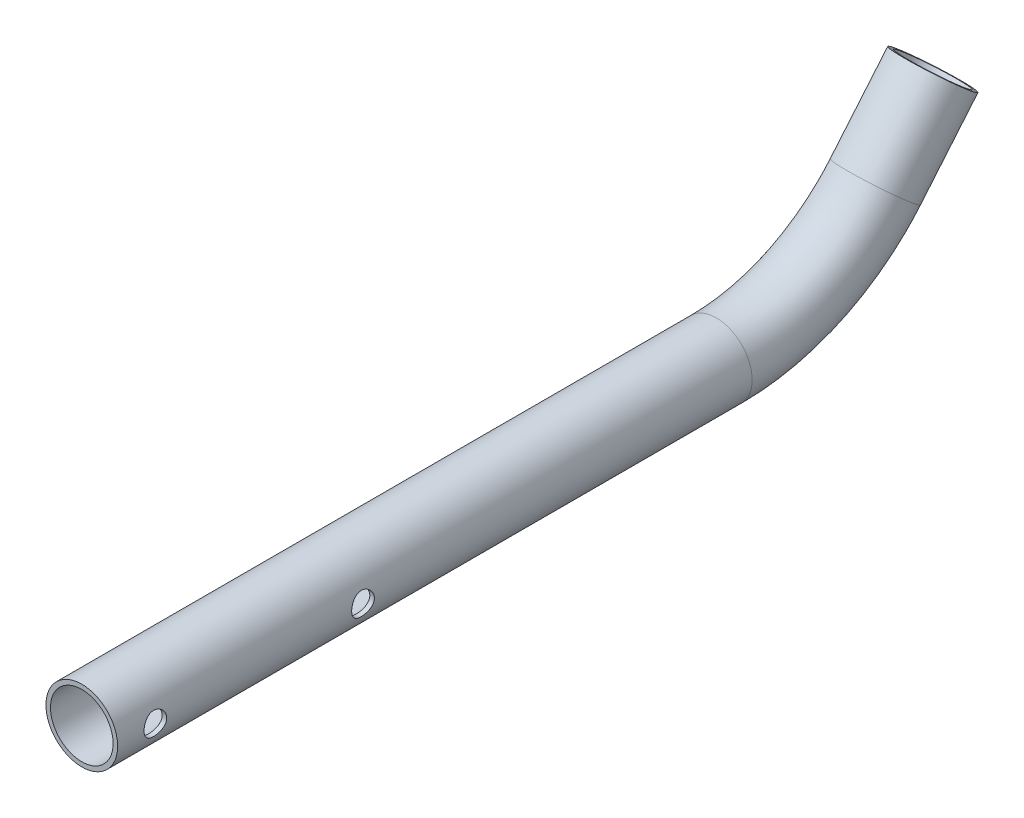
ISO-10303-21;
HEADER;
FILE_DESCRIPTION(('STEP AP214'),'2;1');
FILE_NAME('part.step','',(''),(''),'','','');
FILE_SCHEMA(('AUTOMOTIVE_DESIGN { 1 0 10303 214 1 1 1 1 }'));
ENDSEC;
DATA;
#1=APPLICATION_CONTEXT('core data for automotive mechanical design processes');
#2=APPLICATION_PROTOCOL_DEFINITION('international standard','automotive_design',2000,#1);
#3=PRODUCT_CONTEXT('',#1,'mechanical');
#4=PRODUCT('Part','Part','',(#3));
#5=PRODUCT_RELATED_PRODUCT_CATEGORY('part','',(#4));
#6=PRODUCT_DEFINITION_FORMATION('','',#4);
#7=PRODUCT_DEFINITION_CONTEXT('part definition',#1,'design');
#8=PRODUCT_DEFINITION('design','',#6,#7);
#9=PRODUCT_DEFINITION_SHAPE('','',#8);
#10=(LENGTH_UNIT() NAMED_UNIT(*) SI_UNIT(.MILLI.,.METRE.));
#11=(NAMED_UNIT(*) PLANE_ANGLE_UNIT() SI_UNIT($,.RADIAN.));
#12=(NAMED_UNIT(*) SI_UNIT($,.STERADIAN.) SOLID_ANGLE_UNIT());
#13=UNCERTAINTY_MEASURE_WITH_UNIT(LENGTH_MEASURE(1.E-05),#10,'distance_accuracy_value','');
#14=(GEOMETRIC_REPRESENTATION_CONTEXT(3) GLOBAL_UNCERTAINTY_ASSIGNED_CONTEXT((#13)) GLOBAL_UNIT_ASSIGNED_CONTEXT((#10,
#11,#12)) REPRESENTATION_CONTEXT('',''));
#15=CARTESIAN_POINT('',(0.,0.,0.));
#16=DIRECTION('',(0.,0.,1.));
#17=DIRECTION('',(1.,0.,0.));
#18=AXIS2_PLACEMENT_3D('',#15,#16,#17);
#19=CARTESIAN_POINT('',(0.,19.6466814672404,-210.217557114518));
#20=DIRECTION('',(0.,0.76604444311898,-0.642787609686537));
#21=DIRECTION('',(0.,0.642787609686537,0.76604444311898));
#22=AXIS2_PLACEMENT_3D('',#19,#20,#21);
#23=CYLINDRICAL_SURFACE('',#22,8.30000000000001);
#24=CARTESIAN_POINT('',(0.,37.8,-225.45));
#25=DIRECTION('',(0.,0.76604444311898,-0.642787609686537));
#26=DIRECTION('',(0.,0.642787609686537,0.76604444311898));
#27=AXIS2_PLACEMENT_3D('',#24,#25,#26);
#28=CIRCLE('',#27,8.30000000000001);
#29=CARTESIAN_POINT('',(0.,43.1351371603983,-219.091831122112));
#30=VERTEX_POINT('',#29);
#31=EDGE_CURVE('E17',#30,#30,#28,.T.);
#32=ORIENTED_EDGE('',*,*,#31,.T.);
#33=EDGE_LOOP('',(#32));
#34=FACE_BOUND('',#33,.T.);
#35=CARTESIAN_POINT('',(0.,19.6466814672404,-210.217557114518));
#36=DIRECTION('',(0.,0.76604444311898,-0.642787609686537));
#37=DIRECTION('',(0.,-0.642787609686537,-0.76604444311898));
#38=AXIS2_PLACEMENT_3D('',#35,#36,#37);
#39=CIRCLE('',#38,8.3);
#40=CARTESIAN_POINT('',(0.,14.3115443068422,-216.575725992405));
#41=VERTEX_POINT('',#40);
#42=EDGE_CURVE('E29',#41,#41,#39,.F.);
#43=ORIENTED_EDGE('',*,*,#42,.T.);
#44=EDGE_LOOP('',(#43));
#45=FACE_BOUND('',#44,.T.);
#46=ADVANCED_FACE('F14',(#34,#45),#23,.F.);
#47=CARTESIAN_POINT('',(0.,37.8,-225.45));
#48=DIRECTION('',(0.,-0.766044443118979,0.642787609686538));
#49=DIRECTION('',(0.,-0.642787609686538,-0.766044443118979));
#50=AXIS2_PLACEMENT_3D('',#47,#48,#49);
#51=PLANE('',#50);
#52=CARTESIAN_POINT('',(0.,37.8,-225.45));
#53=DIRECTION('',(0.,0.76604444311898,-0.642787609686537));
#54=DIRECTION('',(0.,0.642787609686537,0.76604444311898));
#55=AXIS2_PLACEMENT_3D('',#52,#53,#54);
#56=CIRCLE('',#55,9.50000000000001);
#57=CARTESIAN_POINT('',(0.,43.9064822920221,-218.17257779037));
#58=VERTEX_POINT('',#57);
#59=EDGE_CURVE('E102',#58,#58,#56,.F.);
#60=ORIENTED_EDGE('',*,*,#59,.F.);
#61=EDGE_LOOP('',(#60));
#62=FACE_BOUND('',#61,.T.);
#63=ORIENTED_EDGE('',*,*,#31,.F.);
#64=EDGE_LOOP('',(#63));
#65=FACE_BOUND('',#64,.T.);
#66=ADVANCED_FACE('F95',(#62,#65),#51,.F.);
#67=CARTESIAN_POINT('',(0.,55.,-168.085112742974));
#68=DIRECTION('',(1.,0.,0.));
#69=DIRECTION('',(0.,0.,-1.));
#70=AXIS2_PLACEMENT_3D('',#67,#68,#69);
#71=TOROIDAL_SURFACE('',#70,55.,8.3);
#72=ORIENTED_EDGE('',*,*,#42,.F.);
#73=EDGE_LOOP('',(#72));
#74=FACE_BOUND('',#73,.T.);
#75=CARTESIAN_POINT('',(0.,0.,-168.085112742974));
#76=DIRECTION('',(0.,0.,1.));
#77=DIRECTION('',(1.,0.,0.));
#78=AXIS2_PLACEMENT_3D('',#75,#76,#77);
#79=CIRCLE('',#78,8.3);
#80=CARTESIAN_POINT('',(8.3,0.,-168.085112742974));
#81=VERTEX_POINT('',#80);
#82=EDGE_CURVE('E100',#81,#81,#79,.T.);
#83=ORIENTED_EDGE('',*,*,#82,.T.);
#84=EDGE_LOOP('',(#83));
#85=FACE_BOUND('',#84,.T.);
#86=ADVANCED_FACE('F91',(#74,#85),#71,.F.);
#87=CARTESIAN_POINT('',(0.,19.6466814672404,-210.217557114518));
#88=DIRECTION('',(0.,0.76604444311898,-0.642787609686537));
#89=DIRECTION('',(0.,0.642787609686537,0.76604444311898));
#90=AXIS2_PLACEMENT_3D('',#87,#88,#89);
#91=CYLINDRICAL_SURFACE('',#90,9.50000000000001);
#92=ORIENTED_EDGE('',*,*,#59,.T.);
#93=EDGE_LOOP('',(#92));
#94=FACE_BOUND('',#93,.T.);
#95=CARTESIAN_POINT('',(0.,19.6466814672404,-210.217557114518));
#96=DIRECTION('',(0.,0.76604444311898,-0.642787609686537));
#97=DIRECTION('',(0.,-0.642787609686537,-0.76604444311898));
#98=AXIS2_PLACEMENT_3D('',#95,#96,#97);
#99=CIRCLE('',#98,9.5);
#100=CARTESIAN_POINT('',(0.,13.5401991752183,-217.494979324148));
#101=VERTEX_POINT('',#100);
#102=EDGE_CURVE('E99',#101,#101,#99,.F.);
#103=ORIENTED_EDGE('',*,*,#102,.F.);
#104=EDGE_LOOP('',(#103));
#105=FACE_BOUND('',#104,.T.);
#106=ADVANCED_FACE('F85',(#94,#105),#91,.T.);
#107=CARTESIAN_POINT('',(0.,0.,-168.085112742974));
#108=DIRECTION('',(0.,0.,1.));
#109=DIRECTION('',(1.,0.,0.));
#110=AXIS2_PLACEMENT_3D('',#107,#108,#109);
#111=CYLINDRICAL_SURFACE('',#110,8.3);
#112=CARTESIAN_POINT('',(8.3,0.,-62.));
#113=CARTESIAN_POINT('',(8.29999202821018,-0.162635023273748,-62.0000110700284));
#114=CARTESIAN_POINT('',(8.29516801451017,-0.325435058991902,-62.0132890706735));
#115=CARTESIAN_POINT('',(8.27636202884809,-0.646363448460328,-62.065933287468));
#116=CARTESIAN_POINT('',(8.26236564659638,-0.804484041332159,-62.1053405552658));
#117=CARTESIAN_POINT('',(8.2267356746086,-1.11111971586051,-62.2086711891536));
#118=CARTESIAN_POINT('',(8.20512122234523,-1.25965777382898,-62.2725331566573));
#119=CARTESIAN_POINT('',(8.15642927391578,-1.54385169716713,-62.4227204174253));
#120=CARTESIAN_POINT('',(8.12935218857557,-1.67950853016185,-62.5090440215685));
#121=CARTESIAN_POINT('',(8.07133328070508,-1.93958161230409,-62.7053296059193));
#122=CARTESIAN_POINT('',(8.0402872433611,-2.0634154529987,-62.8160322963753));
#123=CARTESIAN_POINT('',(7.97836136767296,-2.29122536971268,-63.0563650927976));
#124=CARTESIAN_POINT('',(7.94748158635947,-2.39519500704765,-63.1860013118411));
#125=CARTESIAN_POINT('',(7.88820139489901,-2.58387696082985,-63.4660329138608));
#126=CARTESIAN_POINT('',(7.8599248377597,-2.6677922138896,-63.6169941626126));
#127=CARTESIAN_POINT('',(7.81065520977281,-2.80878709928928,-63.9320715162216));
#128=CARTESIAN_POINT('',(7.78965944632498,-2.86587665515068,-64.0961827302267));
#129=CARTESIAN_POINT('',(7.75843293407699,-2.94934688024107,-64.4262447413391));
#130=CARTESIAN_POINT('',(7.74781759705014,-2.97682883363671,-64.591879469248));
#131=CARTESIAN_POINT('',(7.73742399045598,-3.00374747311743,-64.9257233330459));
#132=CARTESIAN_POINT('',(7.73764163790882,-3.00319472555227,-65.0939314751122));
#133=CARTESIAN_POINT('',(7.74855592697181,-2.97490609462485,-65.4183113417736));
#134=CARTESIAN_POINT('',(7.75867589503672,-2.948666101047,-65.5746364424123));
#135=CARTESIAN_POINT('',(7.78730121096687,-2.87220976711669,-65.8804938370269));
#136=CARTESIAN_POINT('',(7.80580776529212,-2.82198997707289,-66.0300251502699));
#137=CARTESIAN_POINT('',(7.84948967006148,-2.6981243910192,-66.3212182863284));
#138=CARTESIAN_POINT('',(7.87477943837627,-2.62407184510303,-66.462689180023));
#139=CARTESIAN_POINT('',(7.92913514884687,-2.45493236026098,-66.7316364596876));
#140=CARTESIAN_POINT('',(7.95820214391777,-2.3598395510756,-66.859108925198));
#141=CARTESIAN_POINT('',(8.0190374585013,-2.14436468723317,-67.1047577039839));
#142=CARTESIAN_POINT('',(8.05086158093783,-2.02278105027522,-67.2218691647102));
#143=CARTESIAN_POINT('',(8.11207834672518,-1.76131367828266,-67.4343768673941));
#144=CARTESIAN_POINT('',(8.1414698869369,-1.62142171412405,-67.5297632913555));
#145=CARTESIAN_POINT('',(8.1950332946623,-1.32453573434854,-67.6972184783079));
#146=CARTESIAN_POINT('',(8.2191256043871,-1.16732813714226,-67.7689389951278));
#147=CARTESIAN_POINT('',(8.248855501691,-0.923650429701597,-67.855578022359));
#148=CARTESIAN_POINT('',(8.2576950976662,-0.841148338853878,-67.8809613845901));
#149=CARTESIAN_POINT('',(8.27300710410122,-0.674069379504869,-67.9245631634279));
#150=CARTESIAN_POINT('',(8.27948055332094,-0.589493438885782,-67.9427847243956));
#151=CARTESIAN_POINT('',(8.2897307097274,-0.421072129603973,-67.9714998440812));
#152=CARTESIAN_POINT('',(8.29357105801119,-0.337261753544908,-67.9821759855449));
#153=CARTESIAN_POINT('',(8.29870777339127,-0.168982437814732,-67.9964289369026));
#154=CARTESIAN_POINT('',(8.30000414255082,-0.0845134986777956,-68.0000057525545));
#155=CARTESIAN_POINT('',(8.29999202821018,0.162635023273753,-67.9999889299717));
#156=CARTESIAN_POINT('',(8.29516801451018,0.325435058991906,-67.9867109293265));
#157=CARTESIAN_POINT('',(8.27636202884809,0.646363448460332,-67.934066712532));
#158=CARTESIAN_POINT('',(8.26236564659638,0.804484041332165,-67.8946594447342));
#159=CARTESIAN_POINT('',(8.2267356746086,1.11111971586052,-67.7913288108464));
#160=CARTESIAN_POINT('',(8.20512122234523,1.25965777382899,-67.7274668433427));
#161=CARTESIAN_POINT('',(8.15642927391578,1.54385169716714,-67.5772795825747));
#162=CARTESIAN_POINT('',(8.12935218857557,1.67950853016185,-67.4909559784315));
#163=CARTESIAN_POINT('',(8.07133328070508,1.93958161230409,-67.2946703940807));
#164=CARTESIAN_POINT('',(8.04028724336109,2.06341545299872,-67.1839677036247));
#165=CARTESIAN_POINT('',(7.97836136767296,2.29122536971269,-66.9436349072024));
#166=CARTESIAN_POINT('',(7.94748158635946,2.39519500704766,-66.8139986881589));
#167=CARTESIAN_POINT('',(7.88820139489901,2.58387696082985,-66.5339670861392));
#168=CARTESIAN_POINT('',(7.8599248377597,2.6677922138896,-66.3830058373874));
#169=CARTESIAN_POINT('',(7.81065520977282,2.80878709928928,-66.0679284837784));
#170=CARTESIAN_POINT('',(7.78965944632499,2.86587665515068,-65.9038172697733));
#171=CARTESIAN_POINT('',(7.75843293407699,2.94934688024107,-65.5737552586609));
#172=CARTESIAN_POINT('',(7.74781759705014,2.97682883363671,-65.408120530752));
#173=CARTESIAN_POINT('',(7.73742399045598,3.00374747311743,-65.0742766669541));
#174=CARTESIAN_POINT('',(7.73764163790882,3.00319472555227,-64.9060685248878));
#175=CARTESIAN_POINT('',(7.74855592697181,2.97490609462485,-64.5816886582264));
#176=CARTESIAN_POINT('',(7.75867589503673,2.94866610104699,-64.4253635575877));
#177=CARTESIAN_POINT('',(7.78730121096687,2.87220976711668,-64.119506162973));
#178=CARTESIAN_POINT('',(7.80580776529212,2.82198997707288,-63.9699748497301));
#179=CARTESIAN_POINT('',(7.84948967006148,2.69812439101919,-63.6787817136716));
#180=CARTESIAN_POINT('',(7.87477943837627,2.62407184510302,-63.537310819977));
#181=CARTESIAN_POINT('',(7.92913514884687,2.45493236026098,-63.2683635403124));
#182=CARTESIAN_POINT('',(7.95820214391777,2.35983955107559,-63.140891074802));
#183=CARTESIAN_POINT('',(8.0190374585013,2.14436468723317,-62.8952422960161));
#184=CARTESIAN_POINT('',(8.05086158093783,2.02278105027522,-62.7781308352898));
#185=CARTESIAN_POINT('',(8.11207834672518,1.76131367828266,-62.5656231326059));
#186=CARTESIAN_POINT('',(8.1414698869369,1.62142171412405,-62.4702367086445));
#187=CARTESIAN_POINT('',(8.1950332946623,1.32453573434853,-62.3027815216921));
#188=CARTESIAN_POINT('',(8.21912560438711,1.16732813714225,-62.2310610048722));
#189=CARTESIAN_POINT('',(8.248855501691,0.923650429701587,-62.144421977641));
#190=CARTESIAN_POINT('',(8.2576950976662,0.841148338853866,-62.1190386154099));
#191=CARTESIAN_POINT('',(8.27300710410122,0.674069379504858,-62.0754368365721));
#192=CARTESIAN_POINT('',(8.27948055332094,0.589493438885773,-62.0572152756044));
#193=CARTESIAN_POINT('',(8.2897307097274,0.421072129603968,-62.0285001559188));
#194=CARTESIAN_POINT('',(8.29357105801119,0.337261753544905,-62.0178240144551));
#195=CARTESIAN_POINT('',(8.29870777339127,0.168982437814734,-62.0035710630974));
#196=CARTESIAN_POINT('',(8.30000414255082,0.0845134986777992,-61.9999942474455));
#197=CARTESIAN_POINT('',(8.3,0.,-62.));
#198=B_SPLINE_CURVE_WITH_KNOTS('',3,(#112,#113,#114,#115,#116,#117,#118,#119,#120,#121,#122,
#123,#124,#125,#126,#127,#128,#129,#130,#131,#132,#133,#134,#135,#136,#137,#138,#139,#140,#141,
#142,#143,#144,#145,#146,#147,#148,#149,#150,#151,#152,#153,#154,#155,#156,#157,#158,#159,#160,
#161,#162,#163,#164,#165,#166,#167,#168,#169,#170,#171,#172,#173,#174,#175,#176,#177,#178,#179,
#180,#181,#182,#183,#184,#185,#186,#187,#188,#189,#190,#191,#192,#193,#194,#195,#196,#197),
.UNSPECIFIED.,.T.,.F.,(4,2,2,2,2,2,2,2,2,2,2,2,2,2,2,2,2,2,2,2,2,2,2,2,2,2,2,2,2,2,2,2,2,2,2,2,
2,2,2,2,2,2,4),(0.,0.487591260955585,0.975950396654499,1.4630913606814,1.95019570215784,
2.45488066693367,2.95972894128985,3.48216493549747,4.00440751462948,4.506472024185,
5.0083473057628,5.48263519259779,5.95699133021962,6.43991557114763,6.92297471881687,
7.43595440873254,7.94916546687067,8.46962273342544,8.72964167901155,8.98954633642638,
9.24292396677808,9.4963013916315,9.98389265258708,10.472251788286,10.9593927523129,
11.4464970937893,11.9511820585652,12.4560303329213,12.978466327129,13.500708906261,
14.0027734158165,14.5046486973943,14.9789365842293,15.4532927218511,15.9362169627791,
16.4192761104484,16.9322558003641,17.4454668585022,17.965924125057,18.2259430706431,
18.4858477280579,18.7392253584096,18.992602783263),.UNSPECIFIED.);
#199=CARTESIAN_POINT('',(8.3,0.,-62.));
#200=VERTEX_POINT('',#199);
#201=EDGE_CURVE('E69',#200,#200,#198,.T.);
#202=ORIENTED_EDGE('',*,*,#201,.T.);
#203=EDGE_LOOP('',(#202));
#204=FACE_BOUND('',#203,.T.);
#205=CARTESIAN_POINT('',(8.3,0.,-7.));
#206=CARTESIAN_POINT('',(8.29999202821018,-0.162635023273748,-7.00001107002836));
#207=CARTESIAN_POINT('',(8.29516801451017,-0.325435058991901,-7.01328907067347));
#208=CARTESIAN_POINT('',(8.27636202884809,-0.646363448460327,-7.06593328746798));
#209=CARTESIAN_POINT('',(8.26236564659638,-0.804484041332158,-7.10534055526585));
#210=CARTESIAN_POINT('',(8.2267356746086,-1.11111971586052,-7.20867118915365));
#211=CARTESIAN_POINT('',(8.20512122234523,-1.25965777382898,-7.27253315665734));
#212=CARTESIAN_POINT('',(8.15642927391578,-1.54385169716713,-7.42272041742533));
#213=CARTESIAN_POINT('',(8.12935218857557,-1.67950853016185,-7.50904402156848));
#214=CARTESIAN_POINT('',(8.07133328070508,-1.93958161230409,-7.70532960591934));
#215=CARTESIAN_POINT('',(8.0402872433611,-2.0634154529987,-7.81603229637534));
#216=CARTESIAN_POINT('',(7.97836136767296,-2.29122536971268,-8.05636509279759));
#217=CARTESIAN_POINT('',(7.94748158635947,-2.39519500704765,-8.18600131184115));
#218=CARTESIAN_POINT('',(7.88820139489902,-2.58387696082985,-8.46603291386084));
#219=CARTESIAN_POINT('',(7.85992483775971,-2.66779221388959,-8.61699416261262));
#220=CARTESIAN_POINT('',(7.81065520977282,-2.80878709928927,-8.93207151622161));
#221=CARTESIAN_POINT('',(7.78965944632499,-2.86587665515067,-9.09618273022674));
#222=CARTESIAN_POINT('',(7.75843293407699,-2.94934688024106,-9.42624474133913));
#223=CARTESIAN_POINT('',(7.74781759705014,-2.9768288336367,-9.59187946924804));
#224=CARTESIAN_POINT('',(7.73742399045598,-3.00374747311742,-9.92572333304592));
#225=CARTESIAN_POINT('',(7.73764163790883,-3.00319472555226,-10.0939314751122));
#226=CARTESIAN_POINT('',(7.74855592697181,-2.97490609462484,-10.4183113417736));
#227=CARTESIAN_POINT('',(7.75867589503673,-2.94866610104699,-10.5746364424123));
#228=CARTESIAN_POINT('',(7.78730121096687,-2.87220976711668,-10.8804938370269));
#229=CARTESIAN_POINT('',(7.80580776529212,-2.82198997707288,-11.0300251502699));
#230=CARTESIAN_POINT('',(7.84948967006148,-2.69812439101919,-11.3212182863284));
#231=CARTESIAN_POINT('',(7.87477943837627,-2.62407184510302,-11.462689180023));
#232=CARTESIAN_POINT('',(7.92913514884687,-2.45493236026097,-11.7316364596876));
#233=CARTESIAN_POINT('',(7.95820214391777,-2.35983955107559,-11.859108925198));
#234=CARTESIAN_POINT('',(8.0190374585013,-2.14436468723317,-12.1047577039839));
#235=CARTESIAN_POINT('',(8.05086158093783,-2.02278105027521,-12.2218691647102));
#236=CARTESIAN_POINT('',(8.11207834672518,-1.76131367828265,-12.4343768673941));
#237=CARTESIAN_POINT('',(8.1414698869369,-1.62142171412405,-12.5297632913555));
#238=CARTESIAN_POINT('',(8.1950332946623,-1.32453573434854,-12.6972184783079));
#239=CARTESIAN_POINT('',(8.2191256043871,-1.16732813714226,-12.7689389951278));
#240=CARTESIAN_POINT('',(8.248855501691,-0.92365042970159,-12.855578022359));
#241=CARTESIAN_POINT('',(8.2576950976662,-0.84114833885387,-12.8809613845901));
#242=CARTESIAN_POINT('',(8.27300710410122,-0.674069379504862,-12.9245631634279));
#243=CARTESIAN_POINT('',(8.27948055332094,-0.589493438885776,-12.9427847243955));
#244=CARTESIAN_POINT('',(8.2897307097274,-0.42107212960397,-12.9714998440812));
#245=CARTESIAN_POINT('',(8.29357105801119,-0.337261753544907,-12.9821759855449));
#246=CARTESIAN_POINT('',(8.29870777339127,-0.168982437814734,-12.9964289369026));
#247=CARTESIAN_POINT('',(8.30000414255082,-0.0845134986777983,-13.0000057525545));
#248=CARTESIAN_POINT('',(8.29999202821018,0.16263502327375,-12.9999889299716));
#249=CARTESIAN_POINT('',(8.29516801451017,0.325435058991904,-12.9867109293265));
#250=CARTESIAN_POINT('',(8.27636202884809,0.646363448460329,-12.934066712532));
#251=CARTESIAN_POINT('',(8.26236564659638,0.80448404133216,-12.8946594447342));
#252=CARTESIAN_POINT('',(8.2267356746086,1.11111971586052,-12.7913288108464));
#253=CARTESIAN_POINT('',(8.20512122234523,1.25965777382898,-12.7274668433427));
#254=CARTESIAN_POINT('',(8.15642927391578,1.54385169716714,-12.5772795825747));
#255=CARTESIAN_POINT('',(8.12935218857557,1.67950853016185,-12.4909559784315));
#256=CARTESIAN_POINT('',(8.07133328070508,1.93958161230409,-12.2946703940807));
#257=CARTESIAN_POINT('',(8.0402872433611,2.06341545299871,-12.1839677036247));
#258=CARTESIAN_POINT('',(7.97836136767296,2.29122536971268,-11.9436349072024));
#259=CARTESIAN_POINT('',(7.94748158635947,2.39519500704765,-11.8139986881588));
#260=CARTESIAN_POINT('',(7.88820139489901,2.58387696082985,-11.5339670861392));
#261=CARTESIAN_POINT('',(7.85992483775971,2.66779221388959,-11.3830058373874));
#262=CARTESIAN_POINT('',(7.81065520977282,2.80878709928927,-11.0679284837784));
#263=CARTESIAN_POINT('',(7.78965944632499,2.86587665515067,-10.9038172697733));
#264=CARTESIAN_POINT('',(7.75843293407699,2.94934688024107,-10.5737552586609));
#265=CARTESIAN_POINT('',(7.74781759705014,2.9768288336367,-10.408120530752));
#266=CARTESIAN_POINT('',(7.73742399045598,3.00374747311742,-10.0742766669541));
#267=CARTESIAN_POINT('',(7.73764163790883,3.00319472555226,-9.90606852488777));
#268=CARTESIAN_POINT('',(7.74855592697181,2.97490609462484,-9.58168865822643));
#269=CARTESIAN_POINT('',(7.75867589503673,2.94866610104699,-9.4253635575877));
#270=CARTESIAN_POINT('',(7.78730121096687,2.87220976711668,-9.11950616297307));
#271=CARTESIAN_POINT('',(7.80580776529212,2.82198997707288,-8.96997484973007));
#272=CARTESIAN_POINT('',(7.84948967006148,2.69812439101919,-8.67878171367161));
#273=CARTESIAN_POINT('',(7.87477943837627,2.62407184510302,-8.53731081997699));
#274=CARTESIAN_POINT('',(7.92913514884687,2.45493236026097,-8.26836354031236));
#275=CARTESIAN_POINT('',(7.95820214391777,2.35983955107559,-8.14089107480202));
#276=CARTESIAN_POINT('',(8.0190374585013,2.14436468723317,-7.89524229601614));
#277=CARTESIAN_POINT('',(8.05086158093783,2.02278105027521,-7.77813083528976));
#278=CARTESIAN_POINT('',(8.11207834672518,1.76131367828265,-7.56562313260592));
#279=CARTESIAN_POINT('',(8.1414698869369,1.62142171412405,-7.4702367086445));
#280=CARTESIAN_POINT('',(8.1950332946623,1.32453573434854,-7.30278152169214));
#281=CARTESIAN_POINT('',(8.21912560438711,1.16732813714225,-7.23106100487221));
#282=CARTESIAN_POINT('',(8.248855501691,0.923650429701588,-7.14442197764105));
#283=CARTESIAN_POINT('',(8.2576950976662,0.841148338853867,-7.11903861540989));
#284=CARTESIAN_POINT('',(8.27300710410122,0.674069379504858,-7.07543683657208));
#285=CARTESIAN_POINT('',(8.27948055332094,0.589493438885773,-7.05721527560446));
#286=CARTESIAN_POINT('',(8.2897307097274,0.421072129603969,-7.0285001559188));
#287=CARTESIAN_POINT('',(8.29357105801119,0.337261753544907,-7.01782401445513));
#288=CARTESIAN_POINT('',(8.29870777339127,0.168982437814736,-7.0035710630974));
#289=CARTESIAN_POINT('',(8.30000414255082,0.0845134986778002,-6.99999424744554));
#290=CARTESIAN_POINT('',(8.3,0.,-7.));
#291=B_SPLINE_CURVE_WITH_KNOTS('',3,(#205,#206,#207,#208,#209,#210,#211,#212,#213,#214,#215,
#216,#217,#218,#219,#220,#221,#222,#223,#224,#225,#226,#227,#228,#229,#230,#231,#232,#233,#234,
#235,#236,#237,#238,#239,#240,#241,#242,#243,#244,#245,#246,#247,#248,#249,#250,#251,#252,#253,
#254,#255,#256,#257,#258,#259,#260,#261,#262,#263,#264,#265,#266,#267,#268,#269,#270,#271,#272,
#273,#274,#275,#276,#277,#278,#279,#280,#281,#282,#283,#284,#285,#286,#287,#288,#289,#290),
.UNSPECIFIED.,.T.,.F.,(4,2,2,2,2,2,2,2,2,2,2,2,2,2,2,2,2,2,2,2,2,2,2,2,2,2,2,2,2,2,2,2,2,2,2,2,
2,2,2,2,2,2,4),(0.,0.487591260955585,0.975950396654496,1.46309136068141,1.95019570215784,
2.45488066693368,2.95972894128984,3.48216493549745,4.00440751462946,4.50647202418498,
5.00834730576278,5.48263519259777,5.95699133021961,6.43991557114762,6.92297471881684,
7.43595440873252,7.94916546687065,8.46962273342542,8.72964167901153,8.98954633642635,
9.24292396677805,9.49630139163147,9.98389265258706,10.472251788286,10.9593927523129,
11.4464970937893,11.9511820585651,12.4560303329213,12.9784663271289,13.5007089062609,
14.0027734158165,14.5046486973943,14.9789365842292,15.4532927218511,15.9362169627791,
16.4192761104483,16.932255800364,17.4454668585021,17.9659241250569,18.225943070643,
18.4858477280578,18.7392253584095,18.9926027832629),.UNSPECIFIED.);
#292=CARTESIAN_POINT('',(8.3,0.,-7.));
#293=VERTEX_POINT('',#292);
#294=EDGE_CURVE('E65',#293,#293,#291,.T.);
#295=ORIENTED_EDGE('',*,*,#294,.T.);
#296=EDGE_LOOP('',(#295));
#297=FACE_BOUND('',#296,.T.);
#298=CARTESIAN_POINT('',(0.,0.,0.));
#299=DIRECTION('',(0.,0.,1.));
#300=DIRECTION('',(1.,0.,0.));
#301=AXIS2_PLACEMENT_3D('',#298,#299,#300);
#302=CIRCLE('',#301,8.3);
#303=CARTESIAN_POINT('',(8.3,0.,0.));
#304=VERTEX_POINT('',#303);
#305=EDGE_CURVE('E62',#304,#304,#302,.F.);
#306=ORIENTED_EDGE('',*,*,#305,.F.);
#307=EDGE_LOOP('',(#306));
#308=FACE_BOUND('',#307,.T.);
#309=ORIENTED_EDGE('',*,*,#82,.F.);
#310=EDGE_LOOP('',(#309));
#311=FACE_BOUND('',#310,.T.);
#312=ADVANCED_FACE('F79',(#204,#297,#308,#311),#111,.F.);
#313=CARTESIAN_POINT('',(0.,55.,-168.085112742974));
#314=DIRECTION('',(1.,0.,0.));
#315=DIRECTION('',(0.,0.,-1.));
#316=AXIS2_PLACEMENT_3D('',#313,#314,#315);
#317=TOROIDAL_SURFACE('',#316,55.,9.5);
#318=ORIENTED_EDGE('',*,*,#102,.T.);
#319=EDGE_LOOP('',(#318));
#320=FACE_BOUND('',#319,.T.);
#321=CARTESIAN_POINT('',(0.,0.,-168.085112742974));
#322=DIRECTION('',(0.,0.,1.));
#323=DIRECTION('',(1.,0.,0.));
#324=AXIS2_PLACEMENT_3D('',#321,#322,#323);
#325=CIRCLE('',#324,9.5);
#326=CARTESIAN_POINT('',(9.5,0.,-168.085112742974));
#327=VERTEX_POINT('',#326);
#328=EDGE_CURVE('E64',#327,#327,#325,.T.);
#329=ORIENTED_EDGE('',*,*,#328,.F.);
#330=EDGE_LOOP('',(#329));
#331=FACE_BOUND('',#330,.T.);
#332=ADVANCED_FACE('F84',(#320,#331),#317,.T.);
#333=CARTESIAN_POINT('',(22.5,0.,-65.));
#334=DIRECTION('',(-1.,0.,0.));
#335=DIRECTION('',(0.,0.,1.));
#336=AXIS2_PLACEMENT_3D('',#333,#334,#335);
#337=CYLINDRICAL_SURFACE('',#336,3.00000000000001);
#338=ORIENTED_EDGE('',*,*,#201,.F.);
#339=EDGE_LOOP('',(#338));
#340=FACE_BOUND('',#339,.T.);
#341=CARTESIAN_POINT('',(9.5,0.,-68.));
#342=CARTESIAN_POINT('',(9.4999937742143,-0.163947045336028,-67.9999909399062));
#343=CARTESIAN_POINT('',(9.49570969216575,-0.328068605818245,-67.9864986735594));
#344=CARTESIAN_POINT('',(9.47901316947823,-0.651672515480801,-67.9329698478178));
#345=CARTESIAN_POINT('',(9.46658677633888,-0.811146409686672,-67.8928877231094));
#346=CARTESIAN_POINT('',(9.4349679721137,-1.12049232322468,-67.7876731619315));
#347=CARTESIAN_POINT('',(9.41579022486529,-1.27038432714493,-67.7225949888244));
#348=CARTESIAN_POINT('',(9.37264977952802,-1.55707428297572,-67.569425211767));
#349=CARTESIAN_POINT('',(9.34868780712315,-1.69387421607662,-67.4813370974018));
#350=CARTESIAN_POINT('',(9.2976682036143,-1.95488205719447,-67.2817080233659));
#351=CARTESIAN_POINT('',(9.27054182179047,-2.07862012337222,-67.1695703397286));
#352=CARTESIAN_POINT('',(9.21664498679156,-2.3058894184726,-66.9262905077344));
#353=CARTESIAN_POINT('',(9.18987462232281,-2.40941569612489,-66.7951437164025));
#354=CARTESIAN_POINT('',(9.13898586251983,-2.59586956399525,-66.5135020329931));
#355=CARTESIAN_POINT('',(9.11495170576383,-2.67820968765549,-66.3626015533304));
#356=CARTESIAN_POINT('',(9.07328714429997,-2.81614810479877,-66.0482141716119));
#357=CARTESIAN_POINT('',(9.0556549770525,-2.87175375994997,-65.8847307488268));
#358=CARTESIAN_POINT('',(9.02950721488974,-2.95292727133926,-65.5551022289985));
#359=CARTESIAN_POINT('',(9.02072856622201,-2.97936419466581,-65.3891925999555));
#360=CARTESIAN_POINT('',(9.01250122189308,-3.00416514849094,-65.0550782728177));
#361=CARTESIAN_POINT('',(9.01304998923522,-3.00253681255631,-64.8868742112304));
#362=CARTESIAN_POINT('',(9.02318351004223,-2.97193251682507,-64.5601693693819));
#363=CARTESIAN_POINT('',(9.0324017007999,-2.94406591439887,-64.4015513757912));
#364=CARTESIAN_POINT('',(9.05823932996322,-2.863576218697,-64.0913677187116));
#365=CARTESIAN_POINT('',(9.0748596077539,-2.8109503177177,-63.9398028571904));
#366=CARTESIAN_POINT('',(9.1139070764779,-2.68165987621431,-63.6454012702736));
#367=CARTESIAN_POINT('',(9.13641695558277,-2.60464945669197,-63.5027278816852));
#368=CARTESIAN_POINT('',(9.1846682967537,-2.42902069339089,-63.2319750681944));
#369=CARTESIAN_POINT('',(9.21041043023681,-2.33039785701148,-63.1038986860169));
#370=CARTESIAN_POINT('',(9.26368893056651,-2.10893510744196,-62.8597194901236));
#371=CARTESIAN_POINT('',(9.29125313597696,-1.98518405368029,-62.7444476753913));
#372=CARTESIAN_POINT('',(9.34402885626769,-1.71971338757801,-62.5360465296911));
#373=CARTESIAN_POINT('',(9.3692393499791,-1.57798603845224,-62.4429267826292));
#374=CARTESIAN_POINT('',(9.41474581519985,-1.27891839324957,-62.2808909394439));
#375=CARTESIAN_POINT('',(9.43499652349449,-1.12145152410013,-62.2121953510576));
#376=CARTESIAN_POINT('',(9.4679435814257,-0.796582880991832,-62.1026358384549));
#377=CARTESIAN_POINT('',(9.48065545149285,-0.629202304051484,-62.0617147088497));
#378=CARTESIAN_POINT('',(9.49256029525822,-0.383587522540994,-62.0236270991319));
#379=CARTESIAN_POINT('',(9.49534217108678,-0.307177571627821,-62.0147773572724));
#380=CARTESIAN_POINT('',(9.49906348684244,-0.153857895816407,-62.0029616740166));
#381=CARTESIAN_POINT('',(9.50000292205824,-0.0769481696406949,-61.9999957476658));
#382=CARTESIAN_POINT('',(9.4999937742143,0.163947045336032,-62.0000090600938));
#383=CARTESIAN_POINT('',(9.49570969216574,0.32806860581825,-62.0135013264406));
#384=CARTESIAN_POINT('',(9.47901316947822,0.651672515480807,-62.0670301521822));
#385=CARTESIAN_POINT('',(9.46658677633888,0.811146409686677,-62.1071122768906));
#386=CARTESIAN_POINT('',(9.4349679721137,1.12049232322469,-62.2123268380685));
#387=CARTESIAN_POINT('',(9.41579022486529,1.27038432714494,-62.2774050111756));
#388=CARTESIAN_POINT('',(9.37264977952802,1.55707428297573,-62.430574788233));
#389=CARTESIAN_POINT('',(9.34868780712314,1.69387421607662,-62.5186629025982));
#390=CARTESIAN_POINT('',(9.2976682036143,1.95488205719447,-62.7182919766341));
#391=CARTESIAN_POINT('',(9.27054182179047,2.07862012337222,-62.8304296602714));
#392=CARTESIAN_POINT('',(9.21664498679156,2.3058894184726,-63.0737094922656));
#393=CARTESIAN_POINT('',(9.18987462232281,2.40941569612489,-63.2048562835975));
#394=CARTESIAN_POINT('',(9.13898586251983,2.59586956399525,-63.4864979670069));
#395=CARTESIAN_POINT('',(9.11495170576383,2.6782096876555,-63.6373984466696));
#396=CARTESIAN_POINT('',(9.07328714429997,2.81614810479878,-63.9517858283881));
#397=CARTESIAN_POINT('',(9.0556549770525,2.87175375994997,-64.1152692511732));
#398=CARTESIAN_POINT('',(9.02950721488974,2.95292727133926,-64.4448977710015));
#399=CARTESIAN_POINT('',(9.02072856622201,2.97936419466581,-64.6108074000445));
#400=CARTESIAN_POINT('',(9.01250122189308,3.00416514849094,-64.9449217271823));
#401=CARTESIAN_POINT('',(9.01304998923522,3.00253681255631,-65.1131257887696));
#402=CARTESIAN_POINT('',(9.02318351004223,2.97193251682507,-65.4398306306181));
#403=CARTESIAN_POINT('',(9.0324017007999,2.94406591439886,-65.5984486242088));
#404=CARTESIAN_POINT('',(9.05823932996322,2.86357621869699,-65.9086322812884));
#405=CARTESIAN_POINT('',(9.0748596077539,2.81095031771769,-66.0601971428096));
#406=CARTESIAN_POINT('',(9.11390707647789,2.68165987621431,-66.3545987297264));
#407=CARTESIAN_POINT('',(9.13641695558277,2.60464945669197,-66.4972721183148));
#408=CARTESIAN_POINT('',(9.1846682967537,2.42902069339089,-66.7680249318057));
#409=CARTESIAN_POINT('',(9.21041043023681,2.33039785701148,-66.8961013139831));
#410=CARTESIAN_POINT('',(9.26368893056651,2.10893510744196,-67.1402805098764));
#411=CARTESIAN_POINT('',(9.29125313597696,1.98518405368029,-67.2555523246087));
#412=CARTESIAN_POINT('',(9.34402885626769,1.71971338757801,-67.4639534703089));
#413=CARTESIAN_POINT('',(9.3692393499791,1.57798603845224,-67.5570732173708));
#414=CARTESIAN_POINT('',(9.41474581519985,1.27891839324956,-67.7191090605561));
#415=CARTESIAN_POINT('',(9.43499652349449,1.12145152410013,-67.7878046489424));
#416=CARTESIAN_POINT('',(9.4679435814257,0.796582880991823,-67.8973641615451));
#417=CARTESIAN_POINT('',(9.48065545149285,0.629202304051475,-67.9382852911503));
#418=CARTESIAN_POINT('',(9.49256029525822,0.383587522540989,-67.9763729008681));
#419=CARTESIAN_POINT('',(9.49534217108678,0.307177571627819,-67.9852226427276));
#420=CARTESIAN_POINT('',(9.49906348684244,0.153857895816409,-67.9970383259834));
#421=CARTESIAN_POINT('',(9.50000292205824,0.0769481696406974,-68.0000042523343));
#422=CARTESIAN_POINT('',(9.5,0.,-68.));
#423=B_SPLINE_CURVE_WITH_KNOTS('',3,(#341,#342,#343,#344,#345,#346,#347,#348,#349,#350,#351,
#352,#353,#354,#355,#356,#357,#358,#359,#360,#361,#362,#363,#364,#365,#366,#367,#368,#369,#370,
#371,#372,#373,#374,#375,#376,#377,#378,#379,#380,#381,#382,#383,#384,#385,#386,#387,#388,#389,
#390,#391,#392,#393,#394,#395,#396,#397,#398,#399,#400,#401,#402,#403,#404,#405,#406,#407,#408,
#409,#410,#411,#412,#413,#414,#415,#416,#417,#418,#419,#420,#421,#422),.UNSPECIFIED.,.T.,.F.,(4,
2,2,2,2,2,2,2,2,2,2,2,2,2,2,2,2,2,2,2,2,2,2,2,2,2,2,2,2,2,2,2,2,2,2,2,2,2,2,2,4),(0.,
0.491544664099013,0.983933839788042,1.47526008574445,1.96651186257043,2.4717607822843,
2.97713331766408,3.49529282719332,4.01330957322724,4.51543654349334,5.01742694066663,
5.49910302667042,5.98083374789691,6.46972911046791,6.95872619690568,7.47040623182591,
7.98230723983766,8.49871900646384,9.01406389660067,9.24476866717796,9.4754740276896,
9.96701869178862,10.4594078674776,10.9507341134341,11.44198589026,11.9472348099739,
12.4526073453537,12.970766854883,13.4887836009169,13.990910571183,14.4929009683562,
14.97457705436,15.4563077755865,15.9452031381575,16.4342002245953,16.9458802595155,
17.4577812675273,17.9741930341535,18.4895379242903,18.7202426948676,18.9509480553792),.UNSPECIFIED.);
#424=CARTESIAN_POINT('',(9.5,0.,-68.));
#425=VERTEX_POINT('',#424);
#426=EDGE_CURVE('E26',#425,#425,#423,.T.);
#427=ORIENTED_EDGE('',*,*,#426,.F.);
#428=EDGE_LOOP('',(#427));
#429=FACE_BOUND('',#428,.T.);
#430=ADVANCED_FACE('F57',(#340,#429),#337,.F.);
#431=CARTESIAN_POINT('',(22.5,0.,-10.));
#432=DIRECTION('',(-1.,0.,0.));
#433=DIRECTION('',(0.,0.,1.));
#434=AXIS2_PLACEMENT_3D('',#431,#432,#433);
#435=CYLINDRICAL_SURFACE('',#434,3.);
#436=ORIENTED_EDGE('',*,*,#294,.F.);
#437=EDGE_LOOP('',(#436));
#438=FACE_BOUND('',#437,.T.);
#439=CARTESIAN_POINT('',(9.5,0.,-13.));
#440=CARTESIAN_POINT('',(9.4999937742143,-0.163947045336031,-12.9999909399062));
#441=CARTESIAN_POINT('',(9.49570969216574,-0.328068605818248,-12.9864986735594));
#442=CARTESIAN_POINT('',(9.47901316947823,-0.651672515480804,-12.9329698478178));
#443=CARTESIAN_POINT('',(9.46658677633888,-0.811146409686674,-12.8928877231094));
#444=CARTESIAN_POINT('',(9.4349679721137,-1.12049232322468,-12.7876731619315));
#445=CARTESIAN_POINT('',(9.41579022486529,-1.27038432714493,-12.7225949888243));
#446=CARTESIAN_POINT('',(9.37264977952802,-1.55707428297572,-12.569425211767));
#447=CARTESIAN_POINT('',(9.34868780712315,-1.69387421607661,-12.4813370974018));
#448=CARTESIAN_POINT('',(9.2976682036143,-1.95488205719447,-12.2817080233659));
#449=CARTESIAN_POINT('',(9.27054182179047,-2.07862012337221,-12.1695703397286));
#450=CARTESIAN_POINT('',(9.21664498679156,-2.3058894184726,-11.9262905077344));
#451=CARTESIAN_POINT('',(9.18987462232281,-2.40941569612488,-11.7951437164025));
#452=CARTESIAN_POINT('',(9.13898586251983,-2.59586956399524,-11.5135020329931));
#453=CARTESIAN_POINT('',(9.11495170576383,-2.67820968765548,-11.3626015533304));
#454=CARTESIAN_POINT('',(9.07328714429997,-2.81614810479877,-11.0482141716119));
#455=CARTESIAN_POINT('',(9.0556549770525,-2.87175375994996,-10.8847307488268));
#456=CARTESIAN_POINT('',(9.02950721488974,-2.95292727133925,-10.5551022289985));
#457=CARTESIAN_POINT('',(9.02072856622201,-2.9793641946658,-10.3891925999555));
#458=CARTESIAN_POINT('',(9.01250122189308,-3.00416514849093,-10.0550782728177));
#459=CARTESIAN_POINT('',(9.01304998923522,-3.0025368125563,-9.88687421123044));
#460=CARTESIAN_POINT('',(9.02318351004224,-2.97193251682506,-9.56016936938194));
#461=CARTESIAN_POINT('',(9.0324017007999,-2.94406591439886,-9.4015513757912));
#462=CARTESIAN_POINT('',(9.05823932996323,-2.86357621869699,-9.09136771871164));
#463=CARTESIAN_POINT('',(9.0748596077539,-2.81095031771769,-8.93980285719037));
#464=CARTESIAN_POINT('',(9.1139070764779,-2.68165987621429,-8.6454012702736));
#465=CARTESIAN_POINT('',(9.13641695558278,-2.60464945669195,-8.50272788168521));
#466=CARTESIAN_POINT('',(9.18466829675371,-2.42902069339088,-8.23197506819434));
#467=CARTESIAN_POINT('',(9.21041043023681,-2.33039785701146,-8.10389868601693));
#468=CARTESIAN_POINT('',(9.26368893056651,-2.10893510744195,-7.85971949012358));
#469=CARTESIAN_POINT('',(9.29125313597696,-1.98518405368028,-7.74444767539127));
#470=CARTESIAN_POINT('',(9.34402885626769,-1.719713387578,-7.53604652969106));
#471=CARTESIAN_POINT('',(9.3692393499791,-1.57798603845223,-7.44292678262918));
#472=CARTESIAN_POINT('',(9.41474581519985,-1.27891839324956,-7.28089093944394));
#473=CARTESIAN_POINT('',(9.43499652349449,-1.12145152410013,-7.2121953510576));
#474=CARTESIAN_POINT('',(9.4679435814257,-0.796582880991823,-7.10263583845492));
#475=CARTESIAN_POINT('',(9.48065545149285,-0.629202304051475,-7.06171470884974));
#476=CARTESIAN_POINT('',(9.49256029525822,-0.383587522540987,-7.02362709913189));
#477=CARTESIAN_POINT('',(9.49534217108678,-0.307177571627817,-7.01477735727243));
#478=CARTESIAN_POINT('',(9.49906348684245,-0.153857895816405,-7.00296167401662));
#479=CARTESIAN_POINT('',(9.50000292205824,-0.0769481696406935,-6.99999574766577));
#480=CARTESIAN_POINT('',(9.4999937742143,0.163947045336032,-7.00000906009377));
#481=CARTESIAN_POINT('',(9.49570969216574,0.328068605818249,-7.01350132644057));
#482=CARTESIAN_POINT('',(9.47901316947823,0.651672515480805,-7.06703015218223));
#483=CARTESIAN_POINT('',(9.46658677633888,0.811146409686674,-7.10711227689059));
#484=CARTESIAN_POINT('',(9.4349679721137,1.12049232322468,-7.21232683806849));
#485=CARTESIAN_POINT('',(9.41579022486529,1.27038432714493,-7.27740501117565));
#486=CARTESIAN_POINT('',(9.37264977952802,1.55707428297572,-7.43057478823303));
#487=CARTESIAN_POINT('',(9.34868780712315,1.69387421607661,-7.5186629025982));
#488=CARTESIAN_POINT('',(9.2976682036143,1.95488205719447,-7.71829197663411));
#489=CARTESIAN_POINT('',(9.27054182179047,2.07862012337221,-7.83042966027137));
#490=CARTESIAN_POINT('',(9.21664498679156,2.3058894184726,-8.07370949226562));
#491=CARTESIAN_POINT('',(9.18987462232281,2.40941569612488,-8.2048562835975));
#492=CARTESIAN_POINT('',(9.13898586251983,2.59586956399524,-8.48649796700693));
#493=CARTESIAN_POINT('',(9.11495170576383,2.67820968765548,-8.63739844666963));
#494=CARTESIAN_POINT('',(9.07328714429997,2.81614810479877,-8.95178582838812));
#495=CARTESIAN_POINT('',(9.0556549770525,2.87175375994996,-9.11526925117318));
#496=CARTESIAN_POINT('',(9.02950721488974,2.95292727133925,-9.4448977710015));
#497=CARTESIAN_POINT('',(9.02072856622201,2.9793641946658,-9.61080740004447));
#498=CARTESIAN_POINT('',(9.01250122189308,3.00416514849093,-9.94492172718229));
#499=CARTESIAN_POINT('',(9.01304998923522,3.0025368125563,-10.1131257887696));
#500=CARTESIAN_POINT('',(9.02318351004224,2.97193251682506,-10.4398306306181));
#501=CARTESIAN_POINT('',(9.0324017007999,2.94406591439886,-10.5984486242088));
#502=CARTESIAN_POINT('',(9.05823932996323,2.86357621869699,-10.9086322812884));
#503=CARTESIAN_POINT('',(9.0748596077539,2.81095031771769,-11.0601971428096));
#504=CARTESIAN_POINT('',(9.1139070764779,2.68165987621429,-11.3545987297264));
#505=CARTESIAN_POINT('',(9.13641695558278,2.60464945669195,-11.4972721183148));
#506=CARTESIAN_POINT('',(9.18466829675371,2.42902069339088,-11.7680249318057));
#507=CARTESIAN_POINT('',(9.21041043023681,2.33039785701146,-11.8961013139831));
#508=CARTESIAN_POINT('',(9.26368893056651,2.10893510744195,-12.1402805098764));
#509=CARTESIAN_POINT('',(9.29125313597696,1.98518405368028,-12.2555523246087));
#510=CARTESIAN_POINT('',(9.34402885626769,1.719713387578,-12.4639534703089));
#511=CARTESIAN_POINT('',(9.3692393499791,1.57798603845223,-12.5570732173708));
#512=CARTESIAN_POINT('',(9.41474581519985,1.27891839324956,-12.7191090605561));
#513=CARTESIAN_POINT('',(9.43499652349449,1.12145152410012,-12.7878046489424));
#514=CARTESIAN_POINT('',(9.4679435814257,0.796582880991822,-12.8973641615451));
#515=CARTESIAN_POINT('',(9.48065545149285,0.629202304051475,-12.9382852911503));
#516=CARTESIAN_POINT('',(9.49256029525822,0.383587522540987,-12.9763729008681));
#517=CARTESIAN_POINT('',(9.49534217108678,0.307177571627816,-12.9852226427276));
#518=CARTESIAN_POINT('',(9.49906348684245,0.153857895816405,-12.9970383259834));
#519=CARTESIAN_POINT('',(9.50000292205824,0.076948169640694,-13.0000042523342));
#520=CARTESIAN_POINT('',(9.5,0.,-13.));
#521=B_SPLINE_CURVE_WITH_KNOTS('',3,(#439,#440,#441,#442,#443,#444,#445,#446,#447,#448,#449,
#450,#451,#452,#453,#454,#455,#456,#457,#458,#459,#460,#461,#462,#463,#464,#465,#466,#467,#468,
#469,#470,#471,#472,#473,#474,#475,#476,#477,#478,#479,#480,#481,#482,#483,#484,#485,#486,#487,
#488,#489,#490,#491,#492,#493,#494,#495,#496,#497,#498,#499,#500,#501,#502,#503,#504,#505,#506,
#507,#508,#509,#510,#511,#512,#513,#514,#515,#516,#517,#518,#519,#520),.UNSPECIFIED.,.T.,.F.,(4,
2,2,2,2,2,2,2,2,2,2,2,2,2,2,2,2,2,2,2,2,2,2,2,2,2,2,2,2,2,2,2,2,2,2,2,2,2,2,2,4),(0.,
0.491544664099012,0.983933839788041,1.47526008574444,1.96651186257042,2.47176078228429,
2.97713331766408,3.49529282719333,4.01330957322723,4.51543654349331,5.0174269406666,
5.49910302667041,5.98083374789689,6.4697291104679,6.95872619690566,7.4704062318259,
7.98230723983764,8.49871900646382,9.01406389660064,9.24476866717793,9.47547402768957,
9.96701869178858,10.4594078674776,10.950734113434,11.44198589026,11.9472348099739,
12.4526073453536,12.9707668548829,13.4887836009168,13.9909105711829,14.4929009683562,
14.97457705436,15.4563077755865,15.9452031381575,16.4342002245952,16.9458802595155,
17.4577812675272,17.9741930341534,18.4895379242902,18.7202426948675,18.9509480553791),.UNSPECIFIED.);
#522=CARTESIAN_POINT('',(9.5,0.,-13.));
#523=VERTEX_POINT('',#522);
#524=EDGE_CURVE('E21',#523,#523,#521,.T.);
#525=ORIENTED_EDGE('',*,*,#524,.F.);
#526=EDGE_LOOP('',(#525));
#527=FACE_BOUND('',#526,.T.);
#528=ADVANCED_FACE('F42',(#438,#527),#435,.F.);
#529=CARTESIAN_POINT('',(0.,0.,0.));
#530=DIRECTION('',(0.,0.,1.));
#531=DIRECTION('',(1.,0.,0.));
#532=AXIS2_PLACEMENT_3D('',#529,#530,#531);
#533=PLANE('',#532);
#534=CARTESIAN_POINT('',(0.,0.,0.));
#535=DIRECTION('',(0.,0.,1.));
#536=DIRECTION('',(1.,0.,0.));
#537=AXIS2_PLACEMENT_3D('',#534,#535,#536);
#538=CIRCLE('',#537,9.5);
#539=CARTESIAN_POINT('',(9.5,0.,0.));
#540=VERTEX_POINT('',#539);
#541=EDGE_CURVE('E10',#540,#540,#538,.F.);
#542=ORIENTED_EDGE('',*,*,#541,.F.);
#543=EDGE_LOOP('',(#542));
#544=FACE_BOUND('',#543,.T.);
#545=ORIENTED_EDGE('',*,*,#305,.T.);
#546=EDGE_LOOP('',(#545));
#547=FACE_BOUND('',#546,.T.);
#548=ADVANCED_FACE('F48',(#544,#547),#533,.T.);
#549=CARTESIAN_POINT('',(0.,0.,-168.085112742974));
#550=DIRECTION('',(0.,0.,1.));
#551=DIRECTION('',(1.,0.,0.));
#552=AXIS2_PLACEMENT_3D('',#549,#550,#551);
#553=CYLINDRICAL_SURFACE('',#552,9.5);
#554=ORIENTED_EDGE('',*,*,#328,.T.);
#555=EDGE_LOOP('',(#554));
#556=FACE_BOUND('',#555,.T.);
#557=ORIENTED_EDGE('',*,*,#426,.T.);
#558=EDGE_LOOP('',(#557));
#559=FACE_BOUND('',#558,.T.);
#560=ORIENTED_EDGE('',*,*,#524,.T.);
#561=EDGE_LOOP('',(#560));
#562=FACE_BOUND('',#561,.T.);
#563=ORIENTED_EDGE('',*,*,#541,.T.);
#564=EDGE_LOOP('',(#563));
#565=FACE_BOUND('',#564,.T.);
#566=ADVANCED_FACE('F45',(#556,#559,#562,#565),#553,.T.);
#567=CLOSED_SHELL('',(#46,#66,#86,#106,#312,#332,#430,#528,#548,#566));
#568=MANIFOLD_SOLID_BREP('B1',#567);
#569=ADVANCED_BREP_SHAPE_REPRESENTATION('',(#18,#568),#14);
#570=SHAPE_DEFINITION_REPRESENTATION(#9,#569);
ENDSEC;
END-ISO-10303-21;
